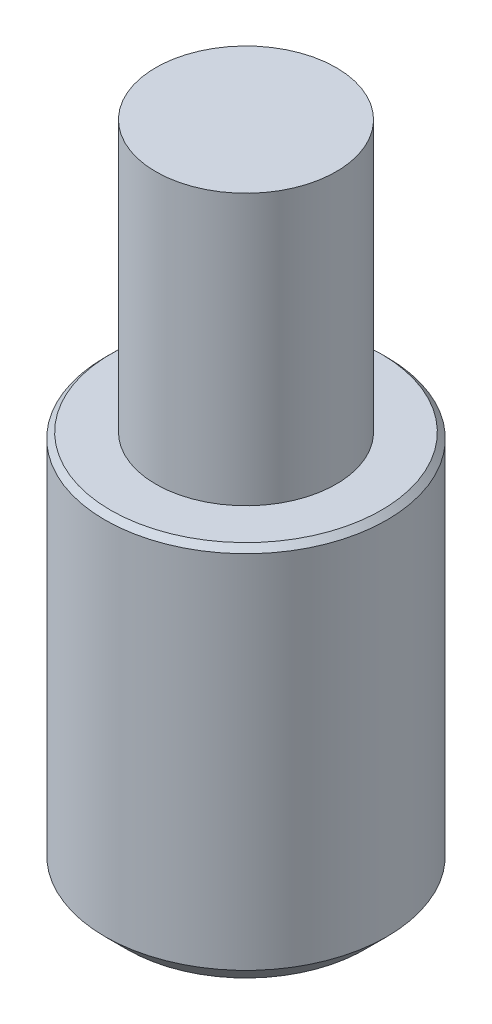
ISO-10303-21;
HEADER;
FILE_DESCRIPTION(('STEP AP214'),'2;1');
FILE_NAME('part.step','',(''),(''),'','','');
FILE_SCHEMA(('AUTOMOTIVE_DESIGN { 1 0 10303 214 1 1 1 1 }'));
ENDSEC;
DATA;
#1=APPLICATION_CONTEXT('core data for automotive mechanical design processes');
#2=APPLICATION_PROTOCOL_DEFINITION('international standard','automotive_design',2000,#1);
#3=PRODUCT_CONTEXT('',#1,'mechanical');
#4=PRODUCT('Part','Part','',(#3));
#5=PRODUCT_RELATED_PRODUCT_CATEGORY('part','',(#4));
#6=PRODUCT_DEFINITION_FORMATION('','',#4);
#7=PRODUCT_DEFINITION_CONTEXT('part definition',#1,'design');
#8=PRODUCT_DEFINITION('design','',#6,#7);
#9=PRODUCT_DEFINITION_SHAPE('','',#8);
#10=(LENGTH_UNIT() NAMED_UNIT(*) SI_UNIT(.MILLI.,.METRE.));
#11=(NAMED_UNIT(*) PLANE_ANGLE_UNIT() SI_UNIT($,.RADIAN.));
#12=(NAMED_UNIT(*) SI_UNIT($,.STERADIAN.) SOLID_ANGLE_UNIT());
#13=UNCERTAINTY_MEASURE_WITH_UNIT(LENGTH_MEASURE(1.E-05),#10,'distance_accuracy_value','');
#14=(GEOMETRIC_REPRESENTATION_CONTEXT(3) GLOBAL_UNCERTAINTY_ASSIGNED_CONTEXT((#13)) GLOBAL_UNIT_ASSIGNED_CONTEXT((#10,
#11,#12)) REPRESENTATION_CONTEXT('',''));
#15=CARTESIAN_POINT('',(0.,0.,0.));
#16=DIRECTION('',(0.,0.,1.));
#17=DIRECTION('',(1.,0.,0.));
#18=AXIS2_PLACEMENT_3D('',#15,#16,#17);
#19=CARTESIAN_POINT('',(0.,8.76299999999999,0.));
#20=DIRECTION('',(0.,1.,0.));
#21=DIRECTION('',(0.,0.,1.));
#22=AXIS2_PLACEMENT_3D('',#19,#20,#21);
#23=PLANE('',#22);
#24=CARTESIAN_POINT('',(0.,8.76299999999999,0.));
#25=DIRECTION('',(0.,1.,0.));
#26=DIRECTION('',(0.,0.,1.));
#27=AXIS2_PLACEMENT_3D('',#24,#25,#26);
#28=CIRCLE('',#27,3.048);
#29=CARTESIAN_POINT('',(0.,8.76299999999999,3.048));
#30=VERTEX_POINT('',#29);
#31=EDGE_CURVE('E159',#30,#30,#28,.T.);
#32=ORIENTED_EDGE('',*,*,#31,.T.);
#33=EDGE_LOOP('',(#32));
#34=FACE_BOUND('',#33,.T.);
#35=CARTESIAN_POINT('',(0.,8.76299999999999,0.));
#36=DIRECTION('',(0.,1.,0.));
#37=DIRECTION('',(0.,0.,1.));
#38=AXIS2_PLACEMENT_3D('',#35,#36,#37);
#39=CIRCLE('',#38,2.032);
#40=CARTESIAN_POINT('',(0.,8.76299999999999,-2.032));
#41=VERTEX_POINT('',#40);
#42=EDGE_CURVE('E150',#41,#41,#39,.T.);
#43=ORIENTED_EDGE('',*,*,#42,.F.);
#44=EDGE_LOOP('',(#43));
#45=FACE_BOUND('',#44,.T.);
#46=ADVANCED_FACE('F48',(#34,#45),#23,.T.);
#47=CARTESIAN_POINT('',(0.,8.76299999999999,0.));
#48=DIRECTION('',(0.,-1.,0.));
#49=DIRECTION('',(0.,0.,-1.));
#50=AXIS2_PLACEMENT_3D('',#47,#48,#49);
#51=CYLINDRICAL_SURFACE('',#50,3.175);
#52=CARTESIAN_POINT('',(0.,0.508000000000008,0.));
#53=DIRECTION('',(0.,1.,0.));
#54=DIRECTION('',(0.,0.,1.));
#55=AXIS2_PLACEMENT_3D('',#52,#53,#54);
#56=CIRCLE('',#55,3.175);
#57=CARTESIAN_POINT('',(0.,0.508000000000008,3.175));
#58=VERTEX_POINT('',#57);
#59=EDGE_CURVE('E56',#58,#58,#56,.T.);
#60=ORIENTED_EDGE('',*,*,#59,.T.);
#61=EDGE_LOOP('',(#60));
#62=FACE_BOUND('',#61,.T.);
#63=CARTESIAN_POINT('',(0.,8.636,0.));
#64=DIRECTION('',(0.,1.,0.));
#65=DIRECTION('',(0.,0.,1.));
#66=AXIS2_PLACEMENT_3D('',#63,#64,#65);
#67=CIRCLE('',#66,3.175);
#68=CARTESIAN_POINT('',(0.,8.636,3.175));
#69=VERTEX_POINT('',#68);
#70=EDGE_CURVE('E164',#69,#69,#67,.F.);
#71=ORIENTED_EDGE('',*,*,#70,.T.);
#72=EDGE_LOOP('',(#71));
#73=FACE_BOUND('',#72,.T.);
#74=ADVANCED_FACE('F169',(#62,#73),#51,.T.);
#75=CARTESIAN_POINT('',(0.,0.,0.));
#76=DIRECTION('',(0.,1.,0.));
#77=DIRECTION('',(0.,0.,1.));
#78=AXIS2_PLACEMENT_3D('',#75,#76,#77);
#79=PLANE('',#78);
#80=CARTESIAN_POINT('',(0.,0.,0.));
#81=DIRECTION('',(0.,1.,0.));
#82=DIRECTION('',(0.,0.,1.));
#83=AXIS2_PLACEMENT_3D('',#80,#81,#82);
#84=CIRCLE('',#83,2.66699999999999);
#85=CARTESIAN_POINT('',(0.,0.,2.667));
#86=VERTEX_POINT('',#85);
#87=EDGE_CURVE('E13',#86,#86,#84,.F.);
#88=ORIENTED_EDGE('',*,*,#87,.T.);
#89=EDGE_LOOP('',(#88));
#90=FACE_BOUND('',#89,.T.);
#91=DIRECTION('',(-1.,0.,0.));
#92=VECTOR('',#91,1.);
#93=CARTESIAN_POINT('',(0.916543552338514,0.,1.58749999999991));
#94=LINE('',#93,#92);
#95=CARTESIAN_POINT('',(0.916543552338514,0.,1.58749999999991));
#96=VERTEX_POINT('',#95);
#97=CARTESIAN_POINT('',(-0.916543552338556,0.,1.58749999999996));
#98=VERTEX_POINT('',#97);
#99=EDGE_CURVE('E137',#96,#98,#94,.T.);
#100=ORIENTED_EDGE('',*,*,#99,.F.);
#101=DIRECTION('',(-0.500000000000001,0.,0.86602540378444));
#102=VECTOR('',#101,1.);
#103=CARTESIAN_POINT('',(1.83308710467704,0.,0.));
#104=LINE('',#103,#102);
#105=CARTESIAN_POINT('',(1.83308710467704,0.,0.));
#106=VERTEX_POINT('',#105);
#107=EDGE_CURVE('E63',#106,#96,#104,.T.);
#108=ORIENTED_EDGE('',*,*,#107,.F.);
#109=DIRECTION('',(0.500000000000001,0.,0.866025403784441));
#110=VECTOR('',#109,1.);
#111=CARTESIAN_POINT('',(0.916543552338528,0.,-1.58750000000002));
#112=LINE('',#111,#110);
#113=CARTESIAN_POINT('',(0.916543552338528,0.,-1.58750000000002));
#114=VERTEX_POINT('',#113);
#115=EDGE_CURVE('E146',#114,#106,#112,.T.);
#116=ORIENTED_EDGE('',*,*,#115,.F.);
#117=DIRECTION('',(1.,0.,0.));
#118=VECTOR('',#117,1.);
#119=CARTESIAN_POINT('',(-0.916543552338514,0.,-1.58750000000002));
#120=LINE('',#119,#118);
#121=CARTESIAN_POINT('',(-0.916543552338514,0.,-1.58750000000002));
#122=VERTEX_POINT('',#121);
#123=EDGE_CURVE('E144',#122,#114,#120,.T.);
#124=ORIENTED_EDGE('',*,*,#123,.F.);
#125=DIRECTION('',(0.5,0.,-0.86602540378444));
#126=VECTOR('',#125,1.);
#127=CARTESIAN_POINT('',(-1.83308710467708,0.,0.));
#128=LINE('',#127,#126);
#129=CARTESIAN_POINT('',(-1.83308710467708,0.,0.));
#130=VERTEX_POINT('',#129);
#131=EDGE_CURVE('E111',#130,#122,#128,.T.);
#132=ORIENTED_EDGE('',*,*,#131,.F.);
#133=DIRECTION('',(-0.5,0.,-0.866025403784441));
#134=VECTOR('',#133,1.);
#135=CARTESIAN_POINT('',(-0.916543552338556,0.,1.58749999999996));
#136=LINE('',#135,#134);
#137=EDGE_CURVE('E140',#98,#130,#136,.T.);
#138=ORIENTED_EDGE('',*,*,#137,.F.);
#139=EDGE_LOOP('',(#100,#108,#116,#124,#132,#138));
#140=FACE_BOUND('',#139,.T.);
#141=ADVANCED_FACE('F186',(#90,#140),#79,.F.);
#142=CARTESIAN_POINT('',(0.,14.859,0.));
#143=DIRECTION('',(0.,-1.,0.));
#144=DIRECTION('',(0.,0.,-1.));
#145=AXIS2_PLACEMENT_3D('',#142,#143,#144);
#146=CYLINDRICAL_SURFACE('',#145,2.032);
#147=CARTESIAN_POINT('',(0.,14.859,0.));
#148=DIRECTION('',(0.,1.,0.));
#149=DIRECTION('',(0.,0.,1.));
#150=AXIS2_PLACEMENT_3D('',#147,#148,#149);
#151=CIRCLE('',#150,2.032);
#152=CARTESIAN_POINT('',(0.,14.859,-2.032));
#153=VERTEX_POINT('',#152);
#154=EDGE_CURVE('E156',#153,#153,#151,.T.);
#155=CARTESIAN_POINT('',(0.,14.859,-2.032));
#156=CARTESIAN_POINT('',(0.,14.7955,-2.032));
#157=CARTESIAN_POINT('',(0.,14.732,-2.032));
#158=CARTESIAN_POINT('',(0.,14.605,-2.032));
#159=CARTESIAN_POINT('',(0.,14.5415,-2.032));
#160=CARTESIAN_POINT('',(0.,14.4145,-2.032));
#161=CARTESIAN_POINT('',(0.,14.351,-2.032));
#162=CARTESIAN_POINT('',(0.,14.224,-2.032));
#163=CARTESIAN_POINT('',(0.,14.1605,-2.032));
#164=CARTESIAN_POINT('',(0.,14.0335,-2.032));
#165=CARTESIAN_POINT('',(0.,13.97,-2.032));
#166=CARTESIAN_POINT('',(0.,13.843,-2.032));
#167=CARTESIAN_POINT('',(0.,13.7795,-2.032));
#168=CARTESIAN_POINT('',(0.,13.6525,-2.032));
#169=CARTESIAN_POINT('',(0.,13.589,-2.032));
#170=CARTESIAN_POINT('',(0.,13.462,-2.032));
#171=CARTESIAN_POINT('',(0.,13.3985,-2.032));
#172=CARTESIAN_POINT('',(0.,13.2715,-2.032));
#173=CARTESIAN_POINT('',(0.,13.208,-2.032));
#174=CARTESIAN_POINT('',(0.,13.081,-2.032));
#175=CARTESIAN_POINT('',(0.,13.0175,-2.032));
#176=CARTESIAN_POINT('',(0.,12.8905,-2.032));
#177=CARTESIAN_POINT('',(0.,12.827,-2.032));
#178=CARTESIAN_POINT('',(0.,12.7,-2.032));
#179=CARTESIAN_POINT('',(0.,12.6365,-2.032));
#180=CARTESIAN_POINT('',(0.,12.5095,-2.032));
#181=CARTESIAN_POINT('',(0.,12.446,-2.032));
#182=CARTESIAN_POINT('',(0.,12.319,-2.032));
#183=CARTESIAN_POINT('',(0.,12.2555,-2.032));
#184=CARTESIAN_POINT('',(0.,12.1285,-2.032));
#185=CARTESIAN_POINT('',(0.,12.065,-2.032));
#186=CARTESIAN_POINT('',(0.,11.938,-2.032));
#187=CARTESIAN_POINT('',(0.,11.8745,-2.032));
#188=CARTESIAN_POINT('',(0.,11.7475,-2.032));
#189=CARTESIAN_POINT('',(0.,11.684,-2.032));
#190=CARTESIAN_POINT('',(0.,11.557,-2.032));
#191=CARTESIAN_POINT('',(0.,11.4935,-2.032));
#192=CARTESIAN_POINT('',(0.,11.3665,-2.032));
#193=CARTESIAN_POINT('',(0.,11.303,-2.032));
#194=CARTESIAN_POINT('',(0.,11.176,-2.032));
#195=CARTESIAN_POINT('',(0.,11.1125,-2.032));
#196=CARTESIAN_POINT('',(0.,10.9855,-2.032));
#197=CARTESIAN_POINT('',(0.,10.922,-2.032));
#198=CARTESIAN_POINT('',(0.,10.795,-2.032));
#199=CARTESIAN_POINT('',(0.,10.7315,-2.032));
#200=CARTESIAN_POINT('',(0.,10.6045,-2.032));
#201=CARTESIAN_POINT('',(0.,10.541,-2.032));
#202=CARTESIAN_POINT('',(0.,10.414,-2.032));
#203=CARTESIAN_POINT('',(0.,10.3505,-2.032));
#204=CARTESIAN_POINT('',(0.,10.2235,-2.032));
#205=CARTESIAN_POINT('',(0.,10.16,-2.032));
#206=CARTESIAN_POINT('',(0.,10.033,-2.032));
#207=CARTESIAN_POINT('',(0.,9.96949999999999,-2.032));
#208=CARTESIAN_POINT('',(0.,9.84249999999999,-2.032));
#209=CARTESIAN_POINT('',(0.,9.77899999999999,-2.032));
#210=CARTESIAN_POINT('',(0.,9.65199999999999,-2.032));
#211=CARTESIAN_POINT('',(0.,9.58849999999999,-2.032));
#212=CARTESIAN_POINT('',(0.,9.46149999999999,-2.032));
#213=CARTESIAN_POINT('',(0.,9.39799999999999,-2.032));
#214=CARTESIAN_POINT('',(0.,9.27099999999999,-2.032));
#215=CARTESIAN_POINT('',(0.,9.20749999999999,-2.032));
#216=CARTESIAN_POINT('',(0.,9.08049999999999,-2.032));
#217=CARTESIAN_POINT('',(0.,9.01699999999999,-2.032));
#218=CARTESIAN_POINT('',(0.,8.88999999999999,-2.032));
#219=CARTESIAN_POINT('',(0.,8.82649999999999,-2.032));
#220=CARTESIAN_POINT('',(0.,8.76299999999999,-2.032));
#221=B_SPLINE_CURVE_WITH_KNOTS('',3,(#155,#156,#157,#158,#159,#160,#161,#162,#163,#164,#165,
#166,#167,#168,#169,#170,#171,#172,#173,#174,#175,#176,#177,#178,#179,#180,#181,#182,#183,#184,
#185,#186,#187,#188,#189,#190,#191,#192,#193,#194,#195,#196,#197,#198,#199,#200,#201,#202,#203,
#204,#205,#206,#207,#208,#209,#210,#211,#212,#213,#214,#215,#216,#217,#218,#219,#220),
.UNSPECIFIED.,.F.,.F.,(4,2,2,2,2,2,2,2,2,2,2,2,2,2,2,2,2,2,2,2,2,2,2,2,2,2,2,2,2,2,2,2,4),(0.,
0.190500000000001,0.381000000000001,0.571500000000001,0.762000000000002,0.952500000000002,1.143,
1.3335,1.524,1.7145,1.905,2.0955,2.286,2.4765,2.667,2.8575,3.048,3.2385,3.429,3.6195,3.81,
4.0005,4.191,4.3815,4.572,4.7625,4.953,5.1435,5.334,5.52450000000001,5.71500000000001,5.9055,
6.096),.UNSPECIFIED.);
#222=EDGE_CURVE('BSEAM191',#153,#41,#221,.T.);
#223=ORIENTED_EDGE('',*,*,#154,.F.);
#224=ORIENTED_EDGE('',*,*,#42,.T.);
#225=ORIENTED_EDGE('',*,*,#222,.T.);
#226=ORIENTED_EDGE('',*,*,#222,.F.);
#227=EDGE_LOOP('',(#223,#225,#224,#226));
#228=FACE_BOUND('',#227,.T.);
#229=ADVANCED_FACE('F191',(#228),#146,.T.);
#230=CARTESIAN_POINT('',(0.,14.859,0.));
#231=DIRECTION('',(0.,1.,0.));
#232=DIRECTION('',(0.,0.,1.));
#233=AXIS2_PLACEMENT_3D('',#230,#231,#232);
#234=PLANE('',#233);
#235=ORIENTED_EDGE('',*,*,#154,.T.);
#236=EDGE_LOOP('',(#235));
#237=FACE_BOUND('',#236,.T.);
#238=ADVANCED_FACE('F198',(#237),#234,.T.);
#239=CARTESIAN_POINT('',(0.,8.76299999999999,0.));
#240=DIRECTION('',(0.,-1.,0.));
#241=DIRECTION('',(0.,0.,-1.));
#242=AXIS2_PLACEMENT_3D('',#239,#240,#241);
#243=CONICAL_SURFACE('',#242,3.048,0.785398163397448);
#244=ORIENTED_EDGE('',*,*,#70,.F.);
#245=EDGE_LOOP('',(#244));
#246=FACE_BOUND('',#245,.T.);
#247=ORIENTED_EDGE('',*,*,#31,.F.);
#248=EDGE_LOOP('',(#247));
#249=FACE_BOUND('',#248,.T.);
#250=ADVANCED_FACE('F195',(#246,#249),#243,.T.);
#251=CARTESIAN_POINT('',(1.83308710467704,3.175,0.));
#252=DIRECTION('',(0.86602540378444,0.,0.500000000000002));
#253=DIRECTION('',(0.500000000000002,0.,-0.86602540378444));
#254=AXIS2_PLACEMENT_3D('',#251,#252,#253);
#255=PLANE('',#254);
#256=ORIENTED_EDGE('',*,*,#107,.T.);
#257=DIRECTION('',(0.,-1.,0.));
#258=VECTOR('',#257,1.);
#259=CARTESIAN_POINT('',(0.916543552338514,3.175,1.58749999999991));
#260=LINE('',#259,#258);
#261=CARTESIAN_POINT('',(0.916543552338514,3.175,1.58749999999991));
#262=VERTEX_POINT('',#261);
#263=EDGE_CURVE('E93',#262,#96,#260,.T.);
#264=ORIENTED_EDGE('',*,*,#263,.F.);
#265=DIRECTION('',(-0.500000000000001,0.,0.86602540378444));
#266=VECTOR('',#265,1.);
#267=CARTESIAN_POINT('',(1.83308710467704,3.175,0.));
#268=LINE('',#267,#266);
#269=CARTESIAN_POINT('',(1.83308710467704,3.175,0.));
#270=VERTEX_POINT('',#269);
#271=EDGE_CURVE('E148',#270,#262,#268,.T.);
#272=ORIENTED_EDGE('',*,*,#271,.F.);
#273=DIRECTION('',(0.,-1.,0.));
#274=VECTOR('',#273,1.);
#275=CARTESIAN_POINT('',(1.83308710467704,3.175,0.));
#276=LINE('',#275,#274);
#277=EDGE_CURVE('E71',#270,#106,#276,.T.);
#278=ORIENTED_EDGE('',*,*,#277,.T.);
#279=EDGE_LOOP('',(#256,#264,#272,#278));
#280=FACE_BOUND('',#279,.T.);
#281=ADVANCED_FACE('F197',(#280),#255,.F.);
#282=CARTESIAN_POINT('',(0.916543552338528,3.175,-1.58750000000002));
#283=DIRECTION('',(0.866025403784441,0.,-0.500000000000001));
#284=DIRECTION('',(-0.500000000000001,0.,-0.866025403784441));
#285=AXIS2_PLACEMENT_3D('',#282,#283,#284);
#286=PLANE('',#285);
#287=ORIENTED_EDGE('',*,*,#115,.T.);
#288=ORIENTED_EDGE('',*,*,#277,.F.);
#289=DIRECTION('',(0.500000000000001,0.,0.866025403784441));
#290=VECTOR('',#289,1.);
#291=CARTESIAN_POINT('',(0.916543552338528,3.175,-1.58750000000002));
#292=LINE('',#291,#290);
#293=CARTESIAN_POINT('',(0.916543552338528,3.175,-1.58750000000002));
#294=VERTEX_POINT('',#293);
#295=EDGE_CURVE('E123',#294,#270,#292,.T.);
#296=ORIENTED_EDGE('',*,*,#295,.F.);
#297=DIRECTION('',(0.,-1.,0.));
#298=VECTOR('',#297,1.);
#299=CARTESIAN_POINT('',(0.916543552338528,3.175,-1.58750000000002));
#300=LINE('',#299,#298);
#301=EDGE_CURVE('E115',#294,#114,#300,.T.);
#302=ORIENTED_EDGE('',*,*,#301,.T.);
#303=EDGE_LOOP('',(#287,#288,#296,#302));
#304=FACE_BOUND('',#303,.T.);
#305=ADVANCED_FACE('F204',(#304),#286,.F.);
#306=CARTESIAN_POINT('',(-0.916543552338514,3.175,-1.58750000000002));
#307=DIRECTION('',(0.,0.,-1.));
#308=DIRECTION('',(-1.,0.,0.));
#309=AXIS2_PLACEMENT_3D('',#306,#307,#308);
#310=PLANE('',#309);
#311=ORIENTED_EDGE('',*,*,#123,.T.);
#312=ORIENTED_EDGE('',*,*,#301,.F.);
#313=DIRECTION('',(1.,0.,0.));
#314=VECTOR('',#313,1.);
#315=CARTESIAN_POINT('',(-0.916543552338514,3.175,-1.58750000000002));
#316=LINE('',#315,#314);
#317=CARTESIAN_POINT('',(-0.916543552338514,3.175,-1.58750000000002));
#318=VERTEX_POINT('',#317);
#319=EDGE_CURVE('E119',#318,#294,#316,.T.);
#320=ORIENTED_EDGE('',*,*,#319,.F.);
#321=DIRECTION('',(0.,-1.,0.));
#322=VECTOR('',#321,1.);
#323=CARTESIAN_POINT('',(-0.916543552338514,3.175,-1.58750000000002));
#324=LINE('',#323,#322);
#325=EDGE_CURVE('E104',#318,#122,#324,.T.);
#326=ORIENTED_EDGE('',*,*,#325,.T.);
#327=EDGE_LOOP('',(#311,#312,#320,#326));
#328=FACE_BOUND('',#327,.T.);
#329=ADVANCED_FACE('F120',(#328),#310,.F.);
#330=CARTESIAN_POINT('',(-1.83308710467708,3.175,0.));
#331=DIRECTION('',(-0.86602540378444,0.,-0.5));
#332=DIRECTION('',(-0.5,0.,0.86602540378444));
#333=AXIS2_PLACEMENT_3D('',#330,#331,#332);
#334=PLANE('',#333);
#335=ORIENTED_EDGE('',*,*,#131,.T.);
#336=ORIENTED_EDGE('',*,*,#325,.F.);
#337=DIRECTION('',(0.5,0.,-0.86602540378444));
#338=VECTOR('',#337,1.);
#339=CARTESIAN_POINT('',(-1.83308710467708,3.175,0.));
#340=LINE('',#339,#338);
#341=CARTESIAN_POINT('',(-1.83308710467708,3.175,0.));
#342=VERTEX_POINT('',#341);
#343=EDGE_CURVE('E108',#342,#318,#340,.T.);
#344=ORIENTED_EDGE('',*,*,#343,.F.);
#345=DIRECTION('',(0.,-1.,0.));
#346=VECTOR('',#345,1.);
#347=CARTESIAN_POINT('',(-1.83308710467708,3.175,0.));
#348=LINE('',#347,#346);
#349=EDGE_CURVE('E116',#342,#130,#348,.T.);
#350=ORIENTED_EDGE('',*,*,#349,.T.);
#351=EDGE_LOOP('',(#335,#336,#344,#350));
#352=FACE_BOUND('',#351,.T.);
#353=ADVANCED_FACE('F106',(#352),#334,.F.);
#354=CARTESIAN_POINT('',(-0.916543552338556,3.175,1.58749999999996));
#355=DIRECTION('',(-0.86602540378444,0.,0.5));
#356=DIRECTION('',(0.5,0.,0.86602540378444));
#357=AXIS2_PLACEMENT_3D('',#354,#355,#356);
#358=PLANE('',#357);
#359=ORIENTED_EDGE('',*,*,#137,.T.);
#360=ORIENTED_EDGE('',*,*,#349,.F.);
#361=DIRECTION('',(-0.5,0.,-0.866025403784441));
#362=VECTOR('',#361,1.);
#363=CARTESIAN_POINT('',(-0.916543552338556,3.175,1.58749999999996));
#364=LINE('',#363,#362);
#365=CARTESIAN_POINT('',(-0.916543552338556,3.175,1.58749999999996));
#366=VERTEX_POINT('',#365);
#367=EDGE_CURVE('E129',#366,#342,#364,.T.);
#368=ORIENTED_EDGE('',*,*,#367,.F.);
#369=DIRECTION('',(0.,-1.,0.));
#370=VECTOR('',#369,1.);
#371=CARTESIAN_POINT('',(-0.916543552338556,3.175,1.58749999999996));
#372=LINE('',#371,#370);
#373=EDGE_CURVE('E153',#366,#98,#372,.T.);
#374=ORIENTED_EDGE('',*,*,#373,.T.);
#375=EDGE_LOOP('',(#359,#360,#368,#374));
#376=FACE_BOUND('',#375,.T.);
#377=ADVANCED_FACE('F217',(#376),#358,.F.);
#378=CARTESIAN_POINT('',(0.916543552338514,3.175,1.58749999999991));
#379=DIRECTION('',(0.,0.,1.));
#380=DIRECTION('',(1.,0.,0.));
#381=AXIS2_PLACEMENT_3D('',#378,#379,#380);
#382=PLANE('',#381);
#383=ORIENTED_EDGE('',*,*,#99,.T.);
#384=ORIENTED_EDGE('',*,*,#373,.F.);
#385=DIRECTION('',(-1.,0.,0.));
#386=VECTOR('',#385,1.);
#387=CARTESIAN_POINT('',(0.916543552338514,3.175,1.58749999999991));
#388=LINE('',#387,#386);
#389=EDGE_CURVE('E131',#262,#366,#388,.T.);
#390=ORIENTED_EDGE('',*,*,#389,.F.);
#391=ORIENTED_EDGE('',*,*,#263,.T.);
#392=EDGE_LOOP('',(#383,#384,#390,#391));
#393=FACE_BOUND('',#392,.T.);
#394=ADVANCED_FACE('F177',(#393),#382,.F.);
#395=CARTESIAN_POINT('',(0.916543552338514,3.175,1.58749999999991));
#396=DIRECTION('',(0.,-1.,0.));
#397=DIRECTION('',(0.,0.,-1.));
#398=AXIS2_PLACEMENT_3D('',#395,#396,#397);
#399=PLANE('',#398);
#400=ORIENTED_EDGE('',*,*,#271,.T.);
#401=ORIENTED_EDGE('',*,*,#389,.T.);
#402=ORIENTED_EDGE('',*,*,#367,.T.);
#403=ORIENTED_EDGE('',*,*,#343,.T.);
#404=ORIENTED_EDGE('',*,*,#319,.T.);
#405=ORIENTED_EDGE('',*,*,#295,.T.);
#406=EDGE_LOOP('',(#400,#401,#402,#403,#404,#405));
#407=FACE_BOUND('',#406,.T.);
#408=ADVANCED_FACE('F126',(#407),#399,.T.);
#409=CARTESIAN_POINT('',(0.,0.508000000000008,0.));
#410=DIRECTION('',(0.,1.,0.));
#411=DIRECTION('',(0.,0.,1.));
#412=AXIS2_PLACEMENT_3D('',#409,#410,#411);
#413=CONICAL_SURFACE('',#412,3.175,0.785398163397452);
#414=ORIENTED_EDGE('',*,*,#87,.F.);
#415=EDGE_LOOP('',(#414));
#416=FACE_BOUND('',#415,.T.);
#417=ORIENTED_EDGE('',*,*,#59,.F.);
#418=EDGE_LOOP('',(#417));
#419=FACE_BOUND('',#418,.T.);
#420=ADVANCED_FACE('F50',(#416,#419),#413,.T.);
#421=CLOSED_SHELL('',(#46,#74,#141,#229,#238,#250,#281,#305,#329,#353,#377,#394,#408,#420));
#422=MANIFOLD_SOLID_BREP('B2',#421);
#423=ADVANCED_BREP_SHAPE_REPRESENTATION('',(#18,#422),#14);
#424=SHAPE_DEFINITION_REPRESENTATION(#9,#423);
ENDSEC;
END-ISO-10303-21;
